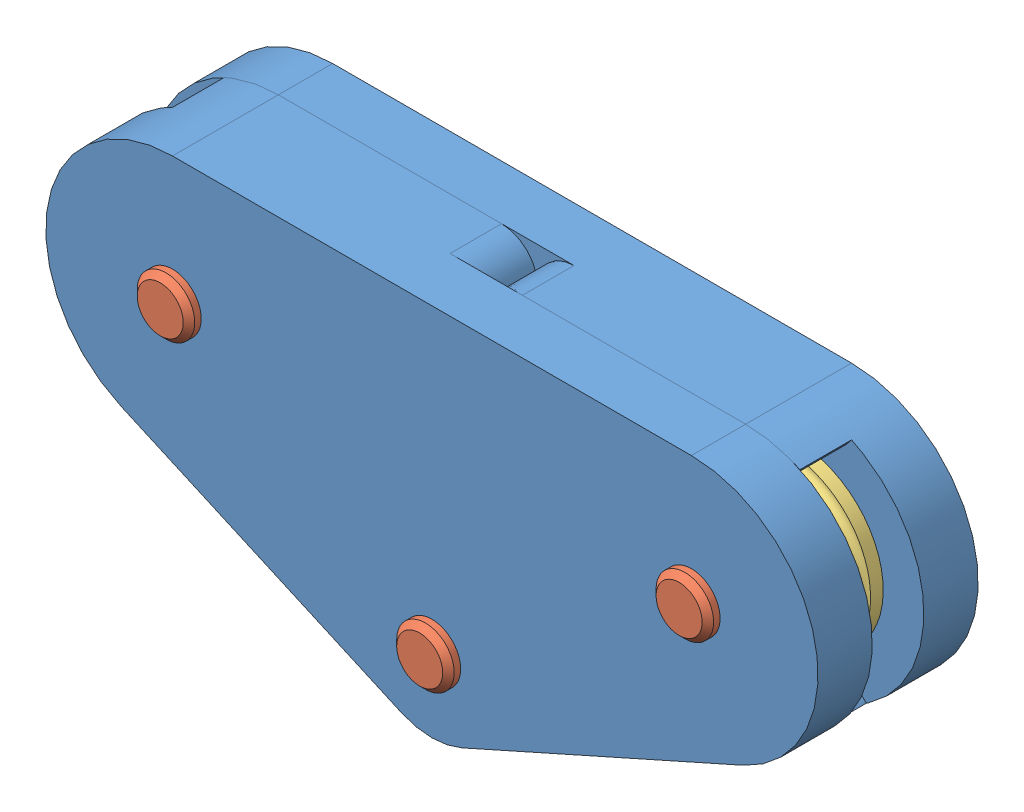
SolidWorks assembly block_differential.SLDASM, configuration Default (file format 5000). Lengths in mm.
Overall size (42.67 20.67 9.53).
7 component instances, 3 part files, 13 mates.
Components (placement in the parent):
- b3-3: b3.SLDPRT [Default] at (-1.2551 3.6629 -2.4338) size (42.67 20.67 5.85)
- b3-2: b3.SLDPRT [Default] at (-1.2551 3.6629 6.4162) x (-1 0 0) z (0 0 -1) size (42.67 20.67 5.85)
- 97395A435-1: 97395A435.SLDPRT [97395A435] at (-15.5884 3.6629 2.3287) x (0 0 -1) z (1 0 0) size (9.53 3.17 3.17)
- 97395A435-2: 97395A435.SLDPRT [97395A435] at (13.0783 3.6629 2.3287) x (0 0 -1) z (1 0 0) size (9.53 3.17 3.17)
- pulley-1: pulley.SLDPRT [Default] at (-15.5884 3.6629 1.7662) x (1 0 0) z (0 1 0) size (9.5 2.4 9.5)
- pulley-2: pulley.SLDPRT [Default] at (13.0783 3.6629 1.7662) x (1 0 0) z (0 1 0) size (9.5 2.4 9.5)
- 97395A435-3: 97395A435.SLDPRT [97395A435] at (-1.2551 -5.9246 2.3287) x (0 0 1) z (-1 0 0) size (9.53 3.17 3.17)
Mates (geometry in assembly coordinates):
- Concentric1: concentric anti-aligned: cylinder of b3-3 through (-15.5884 3.6629 -2.4338) axis (0 0 1) radius 1.5875; cylinder of b3-2 through (-15.5884 3.6629 6.4162) axis (0 0 -1) radius 1.5875
- Concentric2: concentric anti-aligned: cylinder of b3-3 through (13.0783 3.6629 -2.4338) axis (0 0 1) radius 1.5875; cylinder of b3-2 through (13.0783 3.6629 6.4162) axis (0 0 -1) radius 1.5875
- Concentric3: concentric anti-aligned: cylinder of b3-3 through (13.0783 3.6629 -2.4338) axis (0 0 1) radius 1.5875; cylinder of 97395A435-2 through (13.0783 3.6629 7.0912) axis (0 0 -1) radius 1.5875
- Concentric4: concentric anti-aligned: cylinder of b3-3 through (-15.5884 3.6629 -2.4338) axis (0 0 1) radius 1.5875; cylinder of 97395A435-1 through (-15.5884 3.6629 7.0912) axis (0 0 -1) radius 1.5875
- Concentric5: concentric anti-aligned: cylinder of 97395A435-1 through (-15.5884 3.6629 7.0912) axis (0 0 -1) radius 1.5875; cylinder of pulley-1 through (-15.5884 3.6629 1.7662) axis (0 0 1) radius 1.5
- Concentric6: concentric anti-aligned: cylinder of 97395A435-2 through (13.0783 3.6629 7.0912) axis (0 0 -1) radius 1.5875; cylinder of pulley-2 through (13.0783 3.6629 1.7662) axis (0 0 1) radius 1.5
- Coincident1: coincident anti-aligned: plane of b3-3 through (-1.2551 3.6629 3.4162) normal (0 0 1); plane of b3-2 through (13.0783 3.6629 3.4162) normal (0 0 -1)
- Coincident2: coincident aligned: plane of b3-3 through (-15.5884 3.6629 -2.4338) normal (0 0 -1); plane of 97395A435-2 through (13.0783 3.6629 -2.4338) normal (0 0 -1)
- Coincident3: coincident aligned: plane of b3-3 through (-15.5884 3.6629 -2.4338) normal (0 0 -1); plane of 97395A435-1 through (-15.5884 3.6629 -2.4338) normal (0 0 -1)
- Coincident4: coincident anti-aligned: plane of b3-3 through (-15.5884 3.6629 0.5662) normal (0 0 1); plane of pulley-2 through (14.5783 3.6629 0.5662) normal (0 0 -1)
- Coincident5: coincident anti-aligned: plane of b3-3 through (-15.5884 3.6629 0.5662) normal (0 0 1); plane of pulley-1 through (-14.0884 3.6629 0.5662) normal (0 0 -1)
- Concentric7: concentric anti-aligned: cylinder of b3-2 through (-1.2551 -5.9246 6.4162) axis (0 0 -1) radius 1.5875; cylinder of 97395A435-3 through (-1.2551 -5.9246 -2.4338) axis (0 0 1) radius 1.5875
- Coincident6: coincident aligned: plane of b3-3 through (-15.5884 3.6629 -2.4338) normal (0 0 -1); plane of 97395A435-3 through (-1.2551 -5.9246 -2.4338) normal (0 0 -1)
